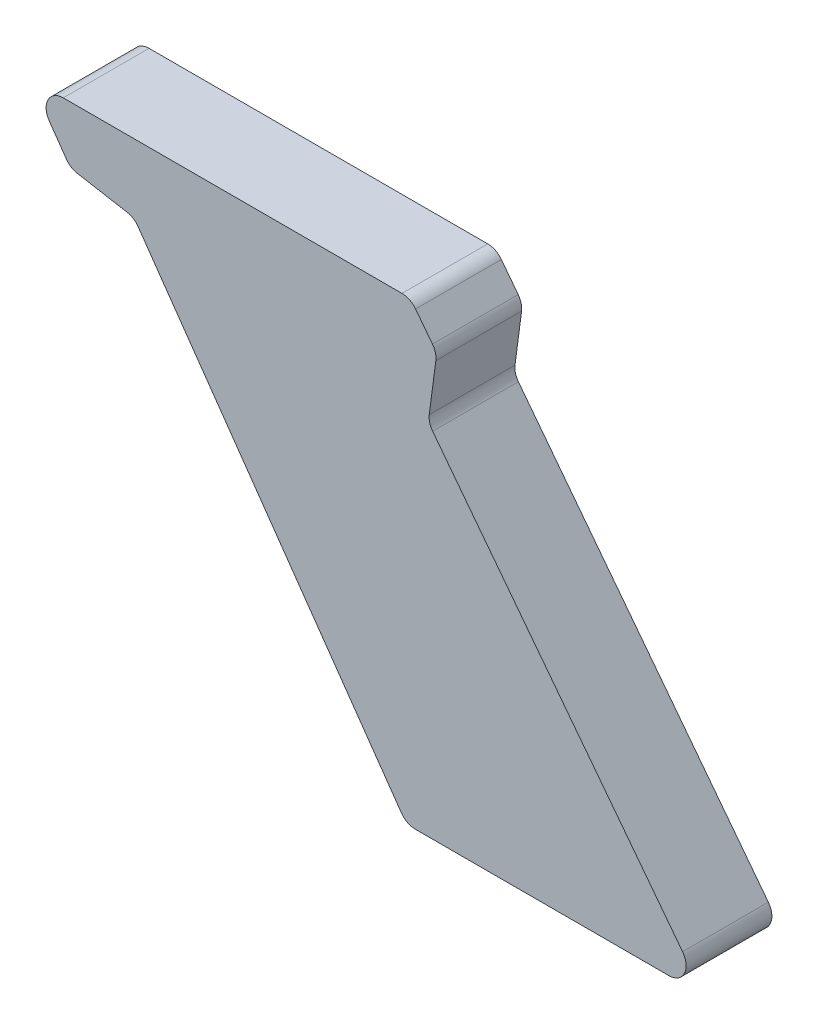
from build123d import *

# Parameters (mm, degrees)
EXTRUDE1_DEPTH = 15


with BuildPart() as part:
    # Sketch1 → Extrude1 (new body)
    with BuildSketch(Plane.XY):
        with BuildLine():
            Line((-3.703338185, 4.826284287), (-47.418681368, 61.797228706))
            ThreePointArc((-47.418681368, 61.797228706), (-47.936398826, 62.847055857), (-48.012955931, 64.015091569))
            Line((-48.012955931, 64.015091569), (-46.860614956, 72.767990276))
            ThreePointArc((-46.860614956, 72.767990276), (-46.937172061, 73.936025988), (-47.454889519, 74.98585314))
            Line((-47.454889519, 74.98585314), (-50.401755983, 78.826284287))
            ThreePointArc((-50.401755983, 78.826284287), (-51.454949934, 79.690618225), (-52.781816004, 80))
            Line((-52.781816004, 80), (-112.019853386, 80))
            ThreePointArc((-112.019853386, 80), (-114.680885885, 78.38524584), (-114.477309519, 75.279270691))
            Line((-114.477309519, 75.279270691), (-111.493473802, 71.017911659))
            ThreePointArc((-111.493473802, 71.017911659), (-110.647916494, 70.208466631), (-109.556962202, 69.784217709))
            Line((-109.556962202, 69.784217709), (-100.862658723, 68.251177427))
            ThreePointArc((-100.862658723, 68.251177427), (-99.77170443, 67.826928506), (-98.926147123, 67.017483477))
            Line((-98.926147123, 67.017483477), (-52.895754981, 1.279270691))
            ThreePointArc((-52.895754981, 1.279270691), (-51.823544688, 0.3389675), (-50.438298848, 0))
            Line((-50.438298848, 0), (-6.083398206, 0))
            ThreePointArc((-6.083398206, 0), (-3.392779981, 1.673133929), (-3.703338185, 4.826284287))
        make_face()
    extrude(amount=EXTRUDE1_DEPTH)


solid = part.part
